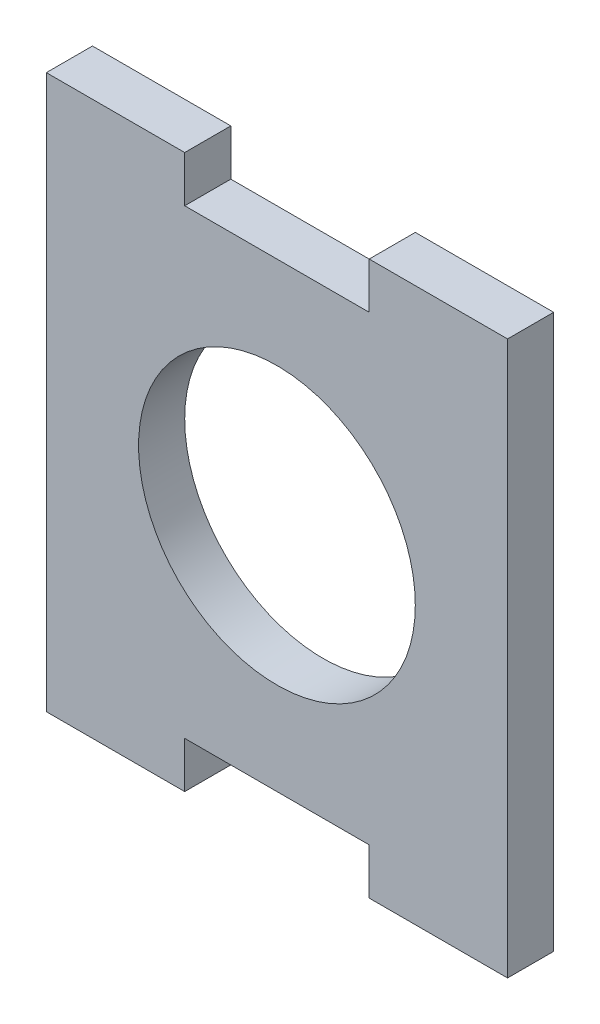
ISO-10303-21;
HEADER;
FILE_DESCRIPTION(('STEP AP214'),'2;1');
FILE_NAME('part.step','',(''),(''),'','','');
FILE_SCHEMA(('AUTOMOTIVE_DESIGN { 1 0 10303 214 1 1 1 1 }'));
ENDSEC;
DATA;
#1=APPLICATION_CONTEXT('core data for automotive mechanical design processes');
#2=APPLICATION_PROTOCOL_DEFINITION('international standard','automotive_design',2000,#1);
#3=PRODUCT_CONTEXT('',#1,'mechanical');
#4=PRODUCT('Part','Part','',(#3));
#5=PRODUCT_RELATED_PRODUCT_CATEGORY('part','',(#4));
#6=PRODUCT_DEFINITION_FORMATION('','',#4);
#7=PRODUCT_DEFINITION_CONTEXT('part definition',#1,'design');
#8=PRODUCT_DEFINITION('design','',#6,#7);
#9=PRODUCT_DEFINITION_SHAPE('','',#8);
#10=(LENGTH_UNIT() NAMED_UNIT(*) SI_UNIT(.MILLI.,.METRE.));
#11=(NAMED_UNIT(*) PLANE_ANGLE_UNIT() SI_UNIT($,.RADIAN.));
#12=(NAMED_UNIT(*) SI_UNIT($,.STERADIAN.) SOLID_ANGLE_UNIT());
#13=UNCERTAINTY_MEASURE_WITH_UNIT(LENGTH_MEASURE(1.E-05),#10,'distance_accuracy_value','');
#14=(GEOMETRIC_REPRESENTATION_CONTEXT(3) GLOBAL_UNCERTAINTY_ASSIGNED_CONTEXT((#13)) GLOBAL_UNIT_ASSIGNED_CONTEXT((#10,
#11,#12)) REPRESENTATION_CONTEXT('',''));
#15=CARTESIAN_POINT('',(0.,0.,0.));
#16=DIRECTION('',(0.,0.,1.));
#17=DIRECTION('',(1.,0.,0.));
#18=AXIS2_PLACEMENT_3D('',#15,#16,#17);
#19=CARTESIAN_POINT('',(-5.,5.99999999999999,0.));
#20=DIRECTION('',(0.,0.,-1.));
#21=DIRECTION('',(-1.,0.,0.));
#22=AXIS2_PLACEMENT_3D('',#19,#20,#21);
#23=PLANE('',#22);
#24=CARTESIAN_POINT('',(0.,0.,0.));
#25=DIRECTION('',(0.,0.,-1.));
#26=DIRECTION('',(-1.,0.,0.));
#27=AXIS2_PLACEMENT_3D('',#24,#25,#26);
#28=CIRCLE('',#27,3.);
#29=CARTESIAN_POINT('',(-3.,0.,0.));
#30=VERTEX_POINT('',#29);
#31=EDGE_CURVE('E144',#30,#30,#28,.F.);
#32=ORIENTED_EDGE('',*,*,#31,.T.);
#33=EDGE_LOOP('',(#32));
#34=FACE_BOUND('',#33,.T.);
#35=DIRECTION('',(0.,-1.,0.));
#36=VECTOR('',#35,1.);
#37=CARTESIAN_POINT('',(-5.,-6.,0.));
#38=LINE('',#37,#36);
#39=CARTESIAN_POINT('',(-5.,5.99999999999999,0.));
#40=VERTEX_POINT('',#39);
#41=CARTESIAN_POINT('',(-5.,-6.,0.));
#42=VERTEX_POINT('',#41);
#43=EDGE_CURVE('E136',#40,#42,#38,.T.);
#44=ORIENTED_EDGE('',*,*,#43,.F.);
#45=DIRECTION('',(-1.,0.,0.));
#46=VECTOR('',#45,1.);
#47=CARTESIAN_POINT('',(-5.,5.99999999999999,0.));
#48=LINE('',#47,#46);
#49=CARTESIAN_POINT('',(-2.,5.99999999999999,0.));
#50=VERTEX_POINT('',#49);
#51=EDGE_CURVE('E176',#50,#40,#48,.T.);
#52=ORIENTED_EDGE('',*,*,#51,.F.);
#53=DIRECTION('',(0.,1.,0.));
#54=VECTOR('',#53,1.);
#55=CARTESIAN_POINT('',(-2.,5.99999999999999,0.));
#56=LINE('',#55,#54);
#57=CARTESIAN_POINT('',(-2.,4.99999999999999,0.));
#58=VERTEX_POINT('',#57);
#59=EDGE_CURVE('E173',#58,#50,#56,.T.);
#60=ORIENTED_EDGE('',*,*,#59,.F.);
#61=DIRECTION('',(-1.,0.,0.));
#62=VECTOR('',#61,1.);
#63=CARTESIAN_POINT('',(-2.,4.99999999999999,0.));
#64=LINE('',#63,#62);
#65=CARTESIAN_POINT('',(2.,4.99999999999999,0.));
#66=VERTEX_POINT('',#65);
#67=EDGE_CURVE('E170',#66,#58,#64,.T.);
#68=ORIENTED_EDGE('',*,*,#67,.F.);
#69=DIRECTION('',(0.,-1.,0.));
#70=VECTOR('',#69,1.);
#71=CARTESIAN_POINT('',(2.,4.99999999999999,0.));
#72=LINE('',#71,#70);
#73=CARTESIAN_POINT('',(2.,5.99999999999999,0.));
#74=VERTEX_POINT('',#73);
#75=EDGE_CURVE('E167',#74,#66,#72,.T.);
#76=ORIENTED_EDGE('',*,*,#75,.F.);
#77=DIRECTION('',(-1.,0.,0.));
#78=VECTOR('',#77,1.);
#79=CARTESIAN_POINT('',(2.,5.99999999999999,0.));
#80=LINE('',#79,#78);
#81=CARTESIAN_POINT('',(5.,5.99999999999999,0.));
#82=VERTEX_POINT('',#81);
#83=EDGE_CURVE('E164',#82,#74,#80,.T.);
#84=ORIENTED_EDGE('',*,*,#83,.F.);
#85=DIRECTION('',(0.,1.,0.));
#86=VECTOR('',#85,1.);
#87=CARTESIAN_POINT('',(5.,5.99999999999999,0.));
#88=LINE('',#87,#86);
#89=CARTESIAN_POINT('',(5.,-6.,0.));
#90=VERTEX_POINT('',#89);
#91=EDGE_CURVE('E161',#90,#82,#88,.T.);
#92=ORIENTED_EDGE('',*,*,#91,.F.);
#93=DIRECTION('',(1.,0.,0.));
#94=VECTOR('',#93,1.);
#95=CARTESIAN_POINT('',(5.,-6.,0.));
#96=LINE('',#95,#94);
#97=CARTESIAN_POINT('',(2.,-6.,0.));
#98=VERTEX_POINT('',#97);
#99=EDGE_CURVE('E158',#98,#90,#96,.T.);
#100=ORIENTED_EDGE('',*,*,#99,.F.);
#101=DIRECTION('',(0.,-1.,0.));
#102=VECTOR('',#101,1.);
#103=CARTESIAN_POINT('',(2.,-6.,0.));
#104=LINE('',#103,#102);
#105=CARTESIAN_POINT('',(2.,-5.,0.));
#106=VERTEX_POINT('',#105);
#107=EDGE_CURVE('E155',#106,#98,#104,.T.);
#108=ORIENTED_EDGE('',*,*,#107,.F.);
#109=DIRECTION('',(1.,0.,0.));
#110=VECTOR('',#109,1.);
#111=CARTESIAN_POINT('',(2.,-5.,0.));
#112=LINE('',#111,#110);
#113=CARTESIAN_POINT('',(-2.,-5.,0.));
#114=VERTEX_POINT('',#113);
#115=EDGE_CURVE('E152',#114,#106,#112,.T.);
#116=ORIENTED_EDGE('',*,*,#115,.F.);
#117=DIRECTION('',(0.,1.,0.));
#118=VECTOR('',#117,1.);
#119=CARTESIAN_POINT('',(-2.,-5.,0.));
#120=LINE('',#119,#118);
#121=CARTESIAN_POINT('',(-2.,-6.,0.));
#122=VERTEX_POINT('',#121);
#123=EDGE_CURVE('E139',#122,#114,#120,.T.);
#124=ORIENTED_EDGE('',*,*,#123,.F.);
#125=DIRECTION('',(1.,0.,0.));
#126=VECTOR('',#125,1.);
#127=CARTESIAN_POINT('',(-2.,-6.,0.));
#128=LINE('',#127,#126);
#129=EDGE_CURVE('E128',#42,#122,#128,.T.);
#130=ORIENTED_EDGE('',*,*,#129,.F.);
#131=EDGE_LOOP('',(#44,#52,#60,#68,#76,#84,#92,#100,#108,#116,#124,#130));
#132=FACE_BOUND('',#131,.T.);
#133=ADVANCED_FACE('F33',(#34,#132),#23,.T.);
#134=CARTESIAN_POINT('',(-5.,5.99999999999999,16.6204993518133));
#135=DIRECTION('',(0.,-1.,0.));
#136=DIRECTION('',(0.,0.,-1.));
#137=AXIS2_PLACEMENT_3D('',#134,#135,#136);
#138=PLANE('',#137);
#139=DIRECTION('',(0.,0.,-1.));
#140=VECTOR('',#139,1.);
#141=CARTESIAN_POINT('',(-5.,5.99999999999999,16.6204993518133));
#142=LINE('',#141,#140);
#143=CARTESIAN_POINT('',(-5.,5.99999999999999,1.));
#144=VERTEX_POINT('',#143);
#145=EDGE_CURVE('E142',#144,#40,#142,.T.);
#146=ORIENTED_EDGE('',*,*,#145,.F.);
#147=DIRECTION('',(1.,0.,0.));
#148=VECTOR('',#147,1.);
#149=CARTESIAN_POINT('',(-5.,5.99999999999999,1.));
#150=LINE('',#149,#148);
#151=CARTESIAN_POINT('',(-2.,5.99999999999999,1.));
#152=VERTEX_POINT('',#151);
#153=EDGE_CURVE('E37',#144,#152,#150,.T.);
#154=ORIENTED_EDGE('',*,*,#153,.T.);
#155=DIRECTION('',(0.,0.,-1.));
#156=VECTOR('',#155,1.);
#157=CARTESIAN_POINT('',(-2.,5.99999999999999,16.6204993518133));
#158=LINE('',#157,#156);
#159=EDGE_CURVE('E179',#152,#50,#158,.T.);
#160=ORIENTED_EDGE('',*,*,#159,.T.);
#161=ORIENTED_EDGE('',*,*,#51,.T.);
#162=EDGE_LOOP('',(#146,#154,#160,#161));
#163=FACE_BOUND('',#162,.T.);
#164=ADVANCED_FACE('F239',(#163),#138,.F.);
#165=CARTESIAN_POINT('',(-2.,5.99999999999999,16.6204993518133));
#166=DIRECTION('',(-1.,0.,0.));
#167=DIRECTION('',(0.,0.,1.));
#168=AXIS2_PLACEMENT_3D('',#165,#166,#167);
#169=PLANE('',#168);
#170=ORIENTED_EDGE('',*,*,#159,.F.);
#171=DIRECTION('',(0.,-1.,0.));
#172=VECTOR('',#171,1.);
#173=CARTESIAN_POINT('',(-2.,5.99999999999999,1.));
#174=LINE('',#173,#172);
#175=CARTESIAN_POINT('',(-2.,4.99999999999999,1.));
#176=VERTEX_POINT('',#175);
#177=EDGE_CURVE('E220',#152,#176,#174,.T.);
#178=ORIENTED_EDGE('',*,*,#177,.T.);
#179=DIRECTION('',(0.,0.,-1.));
#180=VECTOR('',#179,1.);
#181=CARTESIAN_POINT('',(-2.,4.99999999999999,16.6204993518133));
#182=LINE('',#181,#180);
#183=EDGE_CURVE('E181',#176,#58,#182,.T.);
#184=ORIENTED_EDGE('',*,*,#183,.T.);
#185=ORIENTED_EDGE('',*,*,#59,.T.);
#186=EDGE_LOOP('',(#170,#178,#184,#185));
#187=FACE_BOUND('',#186,.T.);
#188=ADVANCED_FACE('F244',(#187),#169,.F.);
#189=CARTESIAN_POINT('',(-2.,4.99999999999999,16.6204993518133));
#190=DIRECTION('',(0.,-1.,0.));
#191=DIRECTION('',(0.,0.,-1.));
#192=AXIS2_PLACEMENT_3D('',#189,#190,#191);
#193=PLANE('',#192);
#194=ORIENTED_EDGE('',*,*,#183,.F.);
#195=DIRECTION('',(1.,0.,0.));
#196=VECTOR('',#195,1.);
#197=CARTESIAN_POINT('',(-2.,4.99999999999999,1.));
#198=LINE('',#197,#196);
#199=CARTESIAN_POINT('',(2.,4.99999999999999,1.));
#200=VERTEX_POINT('',#199);
#201=EDGE_CURVE('E52',#176,#200,#198,.T.);
#202=ORIENTED_EDGE('',*,*,#201,.T.);
#203=DIRECTION('',(0.,0.,-1.));
#204=VECTOR('',#203,1.);
#205=CARTESIAN_POINT('',(2.,4.99999999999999,16.6204993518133));
#206=LINE('',#205,#204);
#207=EDGE_CURVE('E183',#200,#66,#206,.T.);
#208=ORIENTED_EDGE('',*,*,#207,.T.);
#209=ORIENTED_EDGE('',*,*,#67,.T.);
#210=EDGE_LOOP('',(#194,#202,#208,#209));
#211=FACE_BOUND('',#210,.T.);
#212=ADVANCED_FACE('F250',(#211),#193,.F.);
#213=CARTESIAN_POINT('',(2.,4.99999999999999,16.6204993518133));
#214=DIRECTION('',(1.,0.,0.));
#215=DIRECTION('',(0.,0.,-1.));
#216=AXIS2_PLACEMENT_3D('',#213,#214,#215);
#217=PLANE('',#216);
#218=ORIENTED_EDGE('',*,*,#207,.F.);
#219=DIRECTION('',(0.,1.,0.));
#220=VECTOR('',#219,1.);
#221=CARTESIAN_POINT('',(2.,4.99999999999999,1.));
#222=LINE('',#221,#220);
#223=CARTESIAN_POINT('',(2.,5.99999999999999,1.));
#224=VERTEX_POINT('',#223);
#225=EDGE_CURVE('E216',#200,#224,#222,.T.);
#226=ORIENTED_EDGE('',*,*,#225,.T.);
#227=DIRECTION('',(0.,0.,-1.));
#228=VECTOR('',#227,1.);
#229=CARTESIAN_POINT('',(2.,5.99999999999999,16.6204993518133));
#230=LINE('',#229,#228);
#231=EDGE_CURVE('E185',#224,#74,#230,.T.);
#232=ORIENTED_EDGE('',*,*,#231,.T.);
#233=ORIENTED_EDGE('',*,*,#75,.T.);
#234=EDGE_LOOP('',(#218,#226,#232,#233));
#235=FACE_BOUND('',#234,.T.);
#236=ADVANCED_FACE('F254',(#235),#217,.F.);
#237=CARTESIAN_POINT('',(2.,5.99999999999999,16.6204993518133));
#238=DIRECTION('',(0.,-1.,0.));
#239=DIRECTION('',(0.,0.,-1.));
#240=AXIS2_PLACEMENT_3D('',#237,#238,#239);
#241=PLANE('',#240);
#242=ORIENTED_EDGE('',*,*,#231,.F.);
#243=DIRECTION('',(1.,0.,0.));
#244=VECTOR('',#243,1.);
#245=CARTESIAN_POINT('',(2.,5.99999999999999,1.));
#246=LINE('',#245,#244);
#247=CARTESIAN_POINT('',(5.,5.99999999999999,1.));
#248=VERTEX_POINT('',#247);
#249=EDGE_CURVE('E213',#224,#248,#246,.T.);
#250=ORIENTED_EDGE('',*,*,#249,.T.);
#251=DIRECTION('',(0.,0.,-1.));
#252=VECTOR('',#251,1.);
#253=CARTESIAN_POINT('',(5.,5.99999999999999,16.6204993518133));
#254=LINE('',#253,#252);
#255=EDGE_CURVE('E187',#248,#82,#254,.T.);
#256=ORIENTED_EDGE('',*,*,#255,.T.);
#257=ORIENTED_EDGE('',*,*,#83,.T.);
#258=EDGE_LOOP('',(#242,#250,#256,#257));
#259=FACE_BOUND('',#258,.T.);
#260=ADVANCED_FACE('F258',(#259),#241,.F.);
#261=CARTESIAN_POINT('',(5.,5.99999999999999,16.6204993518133));
#262=DIRECTION('',(-1.,0.,0.));
#263=DIRECTION('',(0.,0.,1.));
#264=AXIS2_PLACEMENT_3D('',#261,#262,#263);
#265=PLANE('',#264);
#266=ORIENTED_EDGE('',*,*,#255,.F.);
#267=DIRECTION('',(0.,-1.,0.));
#268=VECTOR('',#267,1.);
#269=CARTESIAN_POINT('',(5.,5.99999999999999,1.));
#270=LINE('',#269,#268);
#271=CARTESIAN_POINT('',(5.,-6.,1.));
#272=VERTEX_POINT('',#271);
#273=EDGE_CURVE('E210',#248,#272,#270,.T.);
#274=ORIENTED_EDGE('',*,*,#273,.T.);
#275=DIRECTION('',(0.,0.,-1.));
#276=VECTOR('',#275,1.);
#277=CARTESIAN_POINT('',(5.,-6.,16.6204993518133));
#278=LINE('',#277,#276);
#279=EDGE_CURVE('E189',#272,#90,#278,.T.);
#280=ORIENTED_EDGE('',*,*,#279,.T.);
#281=ORIENTED_EDGE('',*,*,#91,.T.);
#282=EDGE_LOOP('',(#266,#274,#280,#281));
#283=FACE_BOUND('',#282,.T.);
#284=ADVANCED_FACE('F262',(#283),#265,.F.);
#285=CARTESIAN_POINT('',(5.,-6.,16.6204993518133));
#286=DIRECTION('',(0.,1.,0.));
#287=DIRECTION('',(0.,0.,1.));
#288=AXIS2_PLACEMENT_3D('',#285,#286,#287);
#289=PLANE('',#288);
#290=ORIENTED_EDGE('',*,*,#279,.F.);
#291=DIRECTION('',(-1.,0.,0.));
#292=VECTOR('',#291,1.);
#293=CARTESIAN_POINT('',(5.,-6.,1.));
#294=LINE('',#293,#292);
#295=CARTESIAN_POINT('',(2.,-6.,1.));
#296=VERTEX_POINT('',#295);
#297=EDGE_CURVE('E207',#272,#296,#294,.T.);
#298=ORIENTED_EDGE('',*,*,#297,.T.);
#299=DIRECTION('',(0.,0.,-1.));
#300=VECTOR('',#299,1.);
#301=CARTESIAN_POINT('',(2.,-6.,16.6204993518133));
#302=LINE('',#301,#300);
#303=EDGE_CURVE('E191',#296,#98,#302,.T.);
#304=ORIENTED_EDGE('',*,*,#303,.T.);
#305=ORIENTED_EDGE('',*,*,#99,.T.);
#306=EDGE_LOOP('',(#290,#298,#304,#305));
#307=FACE_BOUND('',#306,.T.);
#308=ADVANCED_FACE('F266',(#307),#289,.F.);
#309=CARTESIAN_POINT('',(2.,-6.,16.6204993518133));
#310=DIRECTION('',(1.,0.,0.));
#311=DIRECTION('',(0.,0.,-1.));
#312=AXIS2_PLACEMENT_3D('',#309,#310,#311);
#313=PLANE('',#312);
#314=ORIENTED_EDGE('',*,*,#303,.F.);
#315=DIRECTION('',(0.,1.,0.));
#316=VECTOR('',#315,1.);
#317=CARTESIAN_POINT('',(2.,-6.,1.));
#318=LINE('',#317,#316);
#319=CARTESIAN_POINT('',(2.,-5.,1.));
#320=VERTEX_POINT('',#319);
#321=EDGE_CURVE('E202',#296,#320,#318,.T.);
#322=ORIENTED_EDGE('',*,*,#321,.T.);
#323=DIRECTION('',(0.,0.,-1.));
#324=VECTOR('',#323,1.);
#325=CARTESIAN_POINT('',(2.,-5.,16.6204993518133));
#326=LINE('',#325,#324);
#327=EDGE_CURVE('E193',#320,#106,#326,.T.);
#328=ORIENTED_EDGE('',*,*,#327,.T.);
#329=ORIENTED_EDGE('',*,*,#107,.T.);
#330=EDGE_LOOP('',(#314,#322,#328,#329));
#331=FACE_BOUND('',#330,.T.);
#332=ADVANCED_FACE('F270',(#331),#313,.F.);
#333=CARTESIAN_POINT('',(2.,-5.,16.6204993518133));
#334=DIRECTION('',(0.,1.,0.));
#335=DIRECTION('',(0.,0.,1.));
#336=AXIS2_PLACEMENT_3D('',#333,#334,#335);
#337=PLANE('',#336);
#338=ORIENTED_EDGE('',*,*,#327,.F.);
#339=DIRECTION('',(-1.,0.,0.));
#340=VECTOR('',#339,1.);
#341=CARTESIAN_POINT('',(2.,-5.,1.));
#342=LINE('',#341,#340);
#343=CARTESIAN_POINT('',(-2.,-5.,1.));
#344=VERTEX_POINT('',#343);
#345=EDGE_CURVE('E200',#320,#344,#342,.T.);
#346=ORIENTED_EDGE('',*,*,#345,.T.);
#347=DIRECTION('',(0.,0.,-1.));
#348=VECTOR('',#347,1.);
#349=CARTESIAN_POINT('',(-2.,-5.,16.6204993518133));
#350=LINE('',#349,#348);
#351=EDGE_CURVE('E195',#344,#114,#350,.T.);
#352=ORIENTED_EDGE('',*,*,#351,.T.);
#353=ORIENTED_EDGE('',*,*,#115,.T.);
#354=EDGE_LOOP('',(#338,#346,#352,#353));
#355=FACE_BOUND('',#354,.T.);
#356=ADVANCED_FACE('F274',(#355),#337,.F.);
#357=CARTESIAN_POINT('',(-2.,-5.,16.6204993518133));
#358=DIRECTION('',(-1.,0.,0.));
#359=DIRECTION('',(0.,0.,1.));
#360=AXIS2_PLACEMENT_3D('',#357,#358,#359);
#361=PLANE('',#360);
#362=ORIENTED_EDGE('',*,*,#351,.F.);
#363=DIRECTION('',(0.,-1.,0.));
#364=VECTOR('',#363,1.);
#365=CARTESIAN_POINT('',(-2.,-5.,1.));
#366=LINE('',#365,#364);
#367=CARTESIAN_POINT('',(-2.,-6.,1.));
#368=VERTEX_POINT('',#367);
#369=EDGE_CURVE('E77',#344,#368,#366,.T.);
#370=ORIENTED_EDGE('',*,*,#369,.T.);
#371=DIRECTION('',(0.,0.,-1.));
#372=VECTOR('',#371,1.);
#373=CARTESIAN_POINT('',(-2.,-6.,16.6204993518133));
#374=LINE('',#373,#372);
#375=EDGE_CURVE('E132',#368,#122,#374,.T.);
#376=ORIENTED_EDGE('',*,*,#375,.T.);
#377=ORIENTED_EDGE('',*,*,#123,.T.);
#378=EDGE_LOOP('',(#362,#370,#376,#377));
#379=FACE_BOUND('',#378,.T.);
#380=ADVANCED_FACE('F198',(#379),#361,.F.);
#381=CARTESIAN_POINT('',(-2.,-6.,16.6204993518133));
#382=DIRECTION('',(0.,1.,0.));
#383=DIRECTION('',(0.,0.,1.));
#384=AXIS2_PLACEMENT_3D('',#381,#382,#383);
#385=PLANE('',#384);
#386=ORIENTED_EDGE('',*,*,#375,.F.);
#387=DIRECTION('',(-1.,0.,0.));
#388=VECTOR('',#387,1.);
#389=CARTESIAN_POINT('',(-2.,-6.,1.));
#390=LINE('',#389,#388);
#391=CARTESIAN_POINT('',(-5.,-6.,1.));
#392=VERTEX_POINT('',#391);
#393=EDGE_CURVE('E43',#368,#392,#390,.T.);
#394=ORIENTED_EDGE('',*,*,#393,.T.);
#395=DIRECTION('',(0.,0.,-1.));
#396=VECTOR('',#395,1.);
#397=CARTESIAN_POINT('',(-5.,-6.,16.6204993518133));
#398=LINE('',#397,#396);
#399=EDGE_CURVE('E125',#392,#42,#398,.T.);
#400=ORIENTED_EDGE('',*,*,#399,.T.);
#401=ORIENTED_EDGE('',*,*,#129,.T.);
#402=EDGE_LOOP('',(#386,#394,#400,#401));
#403=FACE_BOUND('',#402,.T.);
#404=ADVANCED_FACE('F127',(#403),#385,.F.);
#405=CARTESIAN_POINT('',(-5.,-6.,16.6204993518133));
#406=DIRECTION('',(1.,0.,0.));
#407=DIRECTION('',(0.,0.,-1.));
#408=AXIS2_PLACEMENT_3D('',#405,#406,#407);
#409=PLANE('',#408);
#410=ORIENTED_EDGE('',*,*,#399,.F.);
#411=DIRECTION('',(0.,1.,0.));
#412=VECTOR('',#411,1.);
#413=CARTESIAN_POINT('',(-5.,-6.,1.));
#414=LINE('',#413,#412);
#415=EDGE_CURVE('E11',#392,#144,#414,.T.);
#416=ORIENTED_EDGE('',*,*,#415,.T.);
#417=ORIENTED_EDGE('',*,*,#145,.T.);
#418=ORIENTED_EDGE('',*,*,#43,.T.);
#419=EDGE_LOOP('',(#410,#416,#417,#418));
#420=FACE_BOUND('',#419,.T.);
#421=ADVANCED_FACE('F35',(#420),#409,.F.);
#422=CARTESIAN_POINT('',(5.,5.99999999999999,1.));
#423=DIRECTION('',(0.,0.,-1.));
#424=DIRECTION('',(-1.,0.,0.));
#425=AXIS2_PLACEMENT_3D('',#422,#423,#424);
#426=PLANE('',#425);
#427=CARTESIAN_POINT('',(0.,0.,1.));
#428=DIRECTION('',(0.,0.,1.));
#429=DIRECTION('',(1.,0.,0.));
#430=AXIS2_PLACEMENT_3D('',#427,#428,#429);
#431=CIRCLE('',#430,3.);
#432=CARTESIAN_POINT('',(3.,0.,1.));
#433=VERTEX_POINT('',#432);
#434=EDGE_CURVE('E147',#433,#433,#431,.T.);
#435=ORIENTED_EDGE('',*,*,#434,.F.);
#436=EDGE_LOOP('',(#435));
#437=FACE_BOUND('',#436,.T.);
#438=ORIENTED_EDGE('',*,*,#393,.F.);
#439=ORIENTED_EDGE('',*,*,#369,.F.);
#440=ORIENTED_EDGE('',*,*,#345,.F.);
#441=ORIENTED_EDGE('',*,*,#321,.F.);
#442=ORIENTED_EDGE('',*,*,#297,.F.);
#443=ORIENTED_EDGE('',*,*,#273,.F.);
#444=ORIENTED_EDGE('',*,*,#249,.F.);
#445=ORIENTED_EDGE('',*,*,#225,.F.);
#446=ORIENTED_EDGE('',*,*,#201,.F.);
#447=ORIENTED_EDGE('',*,*,#177,.F.);
#448=ORIENTED_EDGE('',*,*,#153,.F.);
#449=ORIENTED_EDGE('',*,*,#415,.F.);
#450=EDGE_LOOP('',(#438,#439,#440,#441,#442,#443,#444,#445,#446,#447,#448,#449));
#451=FACE_BOUND('',#450,.T.);
#452=ADVANCED_FACE('F229',(#437,#451),#426,.F.);
#453=CARTESIAN_POINT('',(0.,0.,-8.48528137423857));
#454=DIRECTION('',(0.,0.,1.));
#455=DIRECTION('',(1.,0.,0.));
#456=AXIS2_PLACEMENT_3D('',#453,#454,#455);
#457=CYLINDRICAL_SURFACE('',#456,3.);
#458=ORIENTED_EDGE('',*,*,#434,.T.);
#459=EDGE_LOOP('',(#458));
#460=FACE_BOUND('',#459,.T.);
#461=ORIENTED_EDGE('',*,*,#31,.F.);
#462=EDGE_LOOP('',(#461));
#463=FACE_BOUND('',#462,.T.);
#464=ADVANCED_FACE('F226',(#460,#463),#457,.F.);
#465=CLOSED_SHELL('',(#133,#164,#188,#212,#236,#260,#284,#308,#332,#356,#380,#404,#421,#452,#464));
#466=MANIFOLD_SOLID_BREP('B2',#465);
#467=ADVANCED_BREP_SHAPE_REPRESENTATION('',(#18,#466),#14);
#468=SHAPE_DEFINITION_REPRESENTATION(#9,#467);
ENDSEC;
END-ISO-10303-21;
